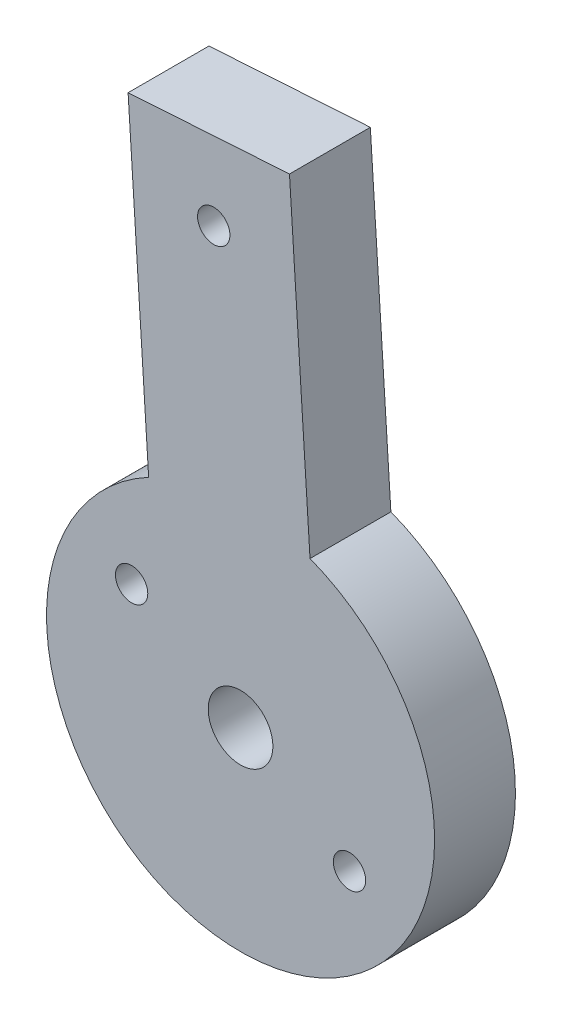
ISO-10303-21;
HEADER;
FILE_DESCRIPTION(('STEP AP214'),'2;1');
FILE_NAME('part.step','',(''),(''),'','','');
FILE_SCHEMA(('AUTOMOTIVE_DESIGN { 1 0 10303 214 1 1 1 1 }'));
ENDSEC;
DATA;
#1=APPLICATION_CONTEXT('core data for automotive mechanical design processes');
#2=APPLICATION_PROTOCOL_DEFINITION('international standard','automotive_design',2000,#1);
#3=PRODUCT_CONTEXT('',#1,'mechanical');
#4=PRODUCT('Part','Part','',(#3));
#5=PRODUCT_RELATED_PRODUCT_CATEGORY('part','',(#4));
#6=PRODUCT_DEFINITION_FORMATION('','',#4);
#7=PRODUCT_DEFINITION_CONTEXT('part definition',#1,'design');
#8=PRODUCT_DEFINITION('design','',#6,#7);
#9=PRODUCT_DEFINITION_SHAPE('','',#8);
#10=(LENGTH_UNIT() NAMED_UNIT(*) SI_UNIT(.MILLI.,.METRE.));
#11=(NAMED_UNIT(*) PLANE_ANGLE_UNIT() SI_UNIT($,.RADIAN.));
#12=(NAMED_UNIT(*) SI_UNIT($,.STERADIAN.) SOLID_ANGLE_UNIT());
#13=UNCERTAINTY_MEASURE_WITH_UNIT(LENGTH_MEASURE(1.E-05),#10,'distance_accuracy_value','');
#14=(GEOMETRIC_REPRESENTATION_CONTEXT(3) GLOBAL_UNCERTAINTY_ASSIGNED_CONTEXT((#13)) GLOBAL_UNIT_ASSIGNED_CONTEXT((#10,
#11,#12)) REPRESENTATION_CONTEXT('',''));
#15=CARTESIAN_POINT('',(0.,0.,0.));
#16=DIRECTION('',(0.,0.,1.));
#17=DIRECTION('',(1.,0.,0.));
#18=AXIS2_PLACEMENT_3D('',#15,#16,#17);
#19=CARTESIAN_POINT('',(0.,0.,5.));
#20=DIRECTION('',(0.,0.,-1.));
#21=DIRECTION('',(-1.,0.,0.));
#22=AXIS2_PLACEMENT_3D('',#19,#20,#21);
#23=CYLINDRICAL_SURFACE('',#22,12.);
#24=CARTESIAN_POINT('',(0.,0.,0.));
#25=DIRECTION('',(0.,0.,1.));
#26=DIRECTION('',(1.,0.,0.));
#27=AXIS2_PLACEMENT_3D('',#24,#25,#26);
#28=CIRCLE('',#27,12.);
#29=CARTESIAN_POINT('',(-5.68309782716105,10.5689355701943,0.));
#30=VERTEX_POINT('',#29);
#31=CARTESIAN_POINT('',(4.29669138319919,11.2043939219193,0.));
#32=VERTEX_POINT('',#31);
#33=EDGE_CURVE('E96',#30,#32,#28,.T.);
#34=ORIENTED_EDGE('',*,*,#33,.T.);
#35=DIRECTION('',(0.,0.,-1.));
#36=VECTOR('',#35,1.);
#37=CARTESIAN_POINT('',(4.29669138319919,11.2043939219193,5.));
#38=LINE('',#37,#36);
#39=CARTESIAN_POINT('',(4.29669138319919,11.2043939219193,5.));
#40=VERTEX_POINT('',#39);
#41=EDGE_CURVE('E11',#40,#32,#38,.T.);
#42=ORIENTED_EDGE('',*,*,#41,.F.);
#43=CARTESIAN_POINT('',(0.,0.,5.));
#44=DIRECTION('',(0.,0.,1.));
#45=DIRECTION('',(1.,0.,0.));
#46=AXIS2_PLACEMENT_3D('',#43,#44,#45);
#47=CIRCLE('',#46,12.);
#48=CARTESIAN_POINT('',(-5.68309782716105,10.5689355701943,5.));
#49=VERTEX_POINT('',#48);
#50=EDGE_CURVE('E84',#49,#40,#47,.T.);
#51=ORIENTED_EDGE('',*,*,#50,.F.);
#52=DIRECTION('',(0.,0.,-1.));
#53=VECTOR('',#52,1.);
#54=CARTESIAN_POINT('',(-5.68309782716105,10.5689355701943,5.));
#55=LINE('',#54,#53);
#56=EDGE_CURVE('E92',#49,#30,#55,.T.);
#57=ORIENTED_EDGE('',*,*,#56,.T.);
#58=EDGE_LOOP('',(#34,#42,#51,#57));
#59=FACE_BOUND('',#58,.T.);
#60=ADVANCED_FACE('F33',(#59),#23,.T.);
#61=CARTESIAN_POINT('',(3.02577467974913,31.1639723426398,5.));
#62=DIRECTION('',(-0.997978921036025,-0.0635458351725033,0.));
#63=DIRECTION('',(0.0635458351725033,-0.997978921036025,0.));
#64=AXIS2_PLACEMENT_3D('',#61,#62,#63);
#65=PLANE('',#64);
#66=DIRECTION('',(-0.0635458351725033,0.997978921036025,0.));
#67=VECTOR('',#66,1.);
#68=CARTESIAN_POINT('',(3.02577467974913,31.1639723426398,0.));
#69=LINE('',#68,#67);
#70=CARTESIAN_POINT('',(3.02577467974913,31.1639723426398,0.));
#71=VERTEX_POINT('',#70);
#72=EDGE_CURVE('E88',#32,#71,#69,.T.);
#73=ORIENTED_EDGE('',*,*,#72,.T.);
#74=DIRECTION('',(0.,0.,-1.));
#75=VECTOR('',#74,1.);
#76=CARTESIAN_POINT('',(3.02577467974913,31.1639723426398,5.));
#77=LINE('',#76,#75);
#78=CARTESIAN_POINT('',(3.02577467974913,31.1639723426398,5.));
#79=VERTEX_POINT('',#78);
#80=EDGE_CURVE('E41',#79,#71,#77,.T.);
#81=ORIENTED_EDGE('',*,*,#80,.F.);
#82=DIRECTION('',(-0.0635458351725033,0.997978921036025,0.));
#83=VECTOR('',#82,1.);
#84=CARTESIAN_POINT('',(3.02577467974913,31.1639723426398,5.));
#85=LINE('',#84,#83);
#86=EDGE_CURVE('E79',#40,#79,#85,.T.);
#87=ORIENTED_EDGE('',*,*,#86,.F.);
#88=ORIENTED_EDGE('',*,*,#41,.T.);
#89=EDGE_LOOP('',(#73,#81,#87,#88));
#90=FACE_BOUND('',#89,.T.);
#91=ADVANCED_FACE('F87',(#90),#65,.F.);
#92=CARTESIAN_POINT('',(-6.95401453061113,30.5285139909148,5.));
#93=DIRECTION('',(0.0635458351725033,-0.997978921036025,0.));
#94=DIRECTION('',(0.997978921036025,0.0635458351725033,0.));
#95=AXIS2_PLACEMENT_3D('',#92,#93,#94);
#96=PLANE('',#95);
#97=DIRECTION('',(-0.997978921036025,-0.0635458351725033,0.));
#98=VECTOR('',#97,1.);
#99=CARTESIAN_POINT('',(-6.95401453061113,30.5285139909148,0.));
#100=LINE('',#99,#98);
#101=CARTESIAN_POINT('',(-6.95401453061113,30.5285139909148,0.));
#102=VERTEX_POINT('',#101);
#103=EDGE_CURVE('E66',#71,#102,#100,.T.);
#104=ORIENTED_EDGE('',*,*,#103,.T.);
#105=DIRECTION('',(0.,0.,-1.));
#106=VECTOR('',#105,1.);
#107=CARTESIAN_POINT('',(-6.95401453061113,30.5285139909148,5.));
#108=LINE('',#107,#106);
#109=CARTESIAN_POINT('',(-6.95401453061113,30.5285139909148,5.));
#110=VERTEX_POINT('',#109);
#111=EDGE_CURVE('E89',#110,#102,#108,.T.);
#112=ORIENTED_EDGE('',*,*,#111,.F.);
#113=DIRECTION('',(-0.997978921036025,-0.0635458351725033,0.));
#114=VECTOR('',#113,1.);
#115=CARTESIAN_POINT('',(-6.95401453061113,30.5285139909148,5.));
#116=LINE('',#115,#114);
#117=EDGE_CURVE('E82',#79,#110,#116,.T.);
#118=ORIENTED_EDGE('',*,*,#117,.F.);
#119=ORIENTED_EDGE('',*,*,#80,.T.);
#120=EDGE_LOOP('',(#104,#112,#118,#119));
#121=FACE_BOUND('',#120,.T.);
#122=ADVANCED_FACE('F90',(#121),#96,.F.);
#123=CARTESIAN_POINT('',(-5.68309782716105,10.5689355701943,5.));
#124=DIRECTION('',(0.997978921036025,0.0635458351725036,0.));
#125=DIRECTION('',(-0.0635458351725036,0.997978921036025,0.));
#126=AXIS2_PLACEMENT_3D('',#123,#124,#125);
#127=PLANE('',#126);
#128=DIRECTION('',(0.0635458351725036,-0.997978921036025,0.));
#129=VECTOR('',#128,1.);
#130=CARTESIAN_POINT('',(-5.68309782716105,10.5689355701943,0.));
#131=LINE('',#130,#129);
#132=EDGE_CURVE('E72',#102,#30,#131,.T.);
#133=ORIENTED_EDGE('',*,*,#132,.T.);
#134=ORIENTED_EDGE('',*,*,#56,.F.);
#135=DIRECTION('',(0.0635458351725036,-0.997978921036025,0.));
#136=VECTOR('',#135,1.);
#137=CARTESIAN_POINT('',(-5.68309782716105,10.5689355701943,5.));
#138=LINE('',#137,#136);
#139=EDGE_CURVE('E49',#110,#49,#138,.T.);
#140=ORIENTED_EDGE('',*,*,#139,.F.);
#141=ORIENTED_EDGE('',*,*,#111,.T.);
#142=EDGE_LOOP('',(#133,#134,#140,#141));
#143=FACE_BOUND('',#142,.T.);
#144=ADVANCED_FACE('F104',(#143),#127,.F.);
#145=CARTESIAN_POINT('',(0.,0.,5.));
#146=DIRECTION('',(0.,0.,1.));
#147=DIRECTION('',(1.,0.,0.));
#148=AXIS2_PLACEMENT_3D('',#145,#146,#147);
#149=PLANE('',#148);
#150=CARTESIAN_POINT('',(-6.73703016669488,4.31421192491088,5.));
#151=DIRECTION('',(0.,0.,1.));
#152=DIRECTION('',(1.,0.,0.));
#153=AXIS2_PLACEMENT_3D('',#150,#151,#152);
#154=CIRCLE('',#153,1.);
#155=CARTESIAN_POINT('',(-5.73703016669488,4.31421192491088,5.));
#156=VERTEX_POINT('',#155);
#157=EDGE_CURVE('E128',#156,#156,#154,.T.);
#158=ORIENTED_EDGE('',*,*,#157,.F.);
#159=EDGE_LOOP('',(#158));
#160=FACE_BOUND('',#159,.T.);
#161=CARTESIAN_POINT('',(6.73703016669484,-4.31421192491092,5.));
#162=DIRECTION('',(0.,0.,1.));
#163=DIRECTION('',(1.,0.,0.));
#164=AXIS2_PLACEMENT_3D('',#161,#162,#163);
#165=CIRCLE('',#164,1.);
#166=CARTESIAN_POINT('',(7.73703016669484,-4.31421192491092,5.));
#167=VERTEX_POINT('',#166);
#168=EDGE_CURVE('E122',#167,#167,#165,.T.);
#169=ORIENTED_EDGE('',*,*,#168,.F.);
#170=EDGE_LOOP('',(#169));
#171=FACE_BOUND('',#170,.T.);
#172=CARTESIAN_POINT('',(-1.65841869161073,26.0452457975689,5.));
#173=DIRECTION('',(0.,0.,1.));
#174=DIRECTION('',(1.,0.,0.));
#175=AXIS2_PLACEMENT_3D('',#172,#173,#174);
#176=CIRCLE('',#175,1.);
#177=CARTESIAN_POINT('',(-0.658418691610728,26.0452457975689,5.));
#178=VERTEX_POINT('',#177);
#179=EDGE_CURVE('E116',#178,#178,#176,.T.);
#180=ORIENTED_EDGE('',*,*,#179,.F.);
#181=EDGE_LOOP('',(#180));
#182=FACE_BOUND('',#181,.T.);
#183=CARTESIAN_POINT('',(0.,0.,5.));
#184=DIRECTION('',(0.,0.,1.));
#185=DIRECTION('',(1.,0.,0.));
#186=AXIS2_PLACEMENT_3D('',#183,#184,#185);
#187=CIRCLE('',#186,2.);
#188=CARTESIAN_POINT('',(2.,0.,5.));
#189=VERTEX_POINT('',#188);
#190=EDGE_CURVE('E110',#189,#189,#187,.T.);
#191=ORIENTED_EDGE('',*,*,#190,.F.);
#192=EDGE_LOOP('',(#191));
#193=FACE_BOUND('',#192,.T.);
#194=ORIENTED_EDGE('',*,*,#50,.T.);
#195=ORIENTED_EDGE('',*,*,#86,.T.);
#196=ORIENTED_EDGE('',*,*,#117,.T.);
#197=ORIENTED_EDGE('',*,*,#139,.T.);
#198=EDGE_LOOP('',(#194,#195,#196,#197));
#199=FACE_BOUND('',#198,.T.);
#200=ADVANCED_FACE('F80',(#160,#171,#182,#193,#199),#149,.T.);
#201=CARTESIAN_POINT('',(0.,0.,0.));
#202=DIRECTION('',(0.,0.,1.));
#203=DIRECTION('',(1.,0.,0.));
#204=AXIS2_PLACEMENT_3D('',#201,#202,#203);
#205=PLANE('',#204);
#206=CARTESIAN_POINT('',(-6.73703016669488,4.31421192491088,0.));
#207=DIRECTION('',(0.,0.,1.));
#208=DIRECTION('',(1.,0.,0.));
#209=AXIS2_PLACEMENT_3D('',#206,#207,#208);
#210=CIRCLE('',#209,1.);
#211=CARTESIAN_POINT('',(-5.73703016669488,4.31421192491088,0.));
#212=VERTEX_POINT('',#211);
#213=EDGE_CURVE('E125',#212,#212,#210,.T.);
#214=ORIENTED_EDGE('',*,*,#213,.T.);
#215=EDGE_LOOP('',(#214));
#216=FACE_BOUND('',#215,.T.);
#217=CARTESIAN_POINT('',(6.73703016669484,-4.31421192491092,0.));
#218=DIRECTION('',(0.,0.,1.));
#219=DIRECTION('',(1.,0.,0.));
#220=AXIS2_PLACEMENT_3D('',#217,#218,#219);
#221=CIRCLE('',#220,1.);
#222=CARTESIAN_POINT('',(7.73703016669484,-4.31421192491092,0.));
#223=VERTEX_POINT('',#222);
#224=EDGE_CURVE('E119',#223,#223,#221,.T.);
#225=ORIENTED_EDGE('',*,*,#224,.T.);
#226=EDGE_LOOP('',(#225));
#227=FACE_BOUND('',#226,.T.);
#228=CARTESIAN_POINT('',(-1.65841869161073,26.0452457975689,0.));
#229=DIRECTION('',(0.,0.,1.));
#230=DIRECTION('',(1.,0.,0.));
#231=AXIS2_PLACEMENT_3D('',#228,#229,#230);
#232=CIRCLE('',#231,1.);
#233=CARTESIAN_POINT('',(-0.658418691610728,26.0452457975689,0.));
#234=VERTEX_POINT('',#233);
#235=EDGE_CURVE('E113',#234,#234,#232,.T.);
#236=ORIENTED_EDGE('',*,*,#235,.T.);
#237=EDGE_LOOP('',(#236));
#238=FACE_BOUND('',#237,.T.);
#239=CARTESIAN_POINT('',(0.,0.,0.));
#240=DIRECTION('',(0.,0.,1.));
#241=DIRECTION('',(1.,0.,0.));
#242=AXIS2_PLACEMENT_3D('',#239,#240,#241);
#243=CIRCLE('',#242,2.);
#244=CARTESIAN_POINT('',(2.,0.,0.));
#245=VERTEX_POINT('',#244);
#246=EDGE_CURVE('E99',#245,#245,#243,.T.);
#247=ORIENTED_EDGE('',*,*,#246,.T.);
#248=EDGE_LOOP('',(#247));
#249=FACE_BOUND('',#248,.T.);
#250=ORIENTED_EDGE('',*,*,#33,.F.);
#251=ORIENTED_EDGE('',*,*,#132,.F.);
#252=ORIENTED_EDGE('',*,*,#103,.F.);
#253=ORIENTED_EDGE('',*,*,#72,.F.);
#254=EDGE_LOOP('',(#250,#251,#252,#253));
#255=FACE_BOUND('',#254,.T.);
#256=ADVANCED_FACE('F107',(#216,#227,#238,#249,#255),#205,.F.);
#257=CARTESIAN_POINT('',(0.,0.,0.));
#258=DIRECTION('',(0.,0.,1.));
#259=DIRECTION('',(1.,0.,0.));
#260=AXIS2_PLACEMENT_3D('',#257,#258,#259);
#261=CYLINDRICAL_SURFACE('',#260,2.);
#262=ORIENTED_EDGE('',*,*,#246,.F.);
#263=EDGE_LOOP('',(#262));
#264=FACE_BOUND('',#263,.T.);
#265=ORIENTED_EDGE('',*,*,#190,.T.);
#266=EDGE_LOOP('',(#265));
#267=FACE_BOUND('',#266,.T.);
#268=ADVANCED_FACE('F152',(#264,#267),#261,.F.);
#269=CARTESIAN_POINT('',(-1.65841869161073,26.0452457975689,0.));
#270=DIRECTION('',(0.,0.,1.));
#271=DIRECTION('',(1.,0.,0.));
#272=AXIS2_PLACEMENT_3D('',#269,#270,#271);
#273=CYLINDRICAL_SURFACE('',#272,1.);
#274=ORIENTED_EDGE('',*,*,#235,.F.);
#275=EDGE_LOOP('',(#274));
#276=FACE_BOUND('',#275,.T.);
#277=ORIENTED_EDGE('',*,*,#179,.T.);
#278=EDGE_LOOP('',(#277));
#279=FACE_BOUND('',#278,.T.);
#280=ADVANCED_FACE('F154',(#276,#279),#273,.F.);
#281=CARTESIAN_POINT('',(6.73703016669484,-4.31421192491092,0.));
#282=DIRECTION('',(0.,0.,1.));
#283=DIRECTION('',(1.,0.,0.));
#284=AXIS2_PLACEMENT_3D('',#281,#282,#283);
#285=CYLINDRICAL_SURFACE('',#284,1.);
#286=ORIENTED_EDGE('',*,*,#224,.F.);
#287=EDGE_LOOP('',(#286));
#288=FACE_BOUND('',#287,.T.);
#289=ORIENTED_EDGE('',*,*,#168,.T.);
#290=EDGE_LOOP('',(#289));
#291=FACE_BOUND('',#290,.T.);
#292=ADVANCED_FACE('F139',(#288,#291),#285,.F.);
#293=CARTESIAN_POINT('',(-6.73703016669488,4.31421192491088,0.));
#294=DIRECTION('',(0.,0.,1.));
#295=DIRECTION('',(1.,0.,0.));
#296=AXIS2_PLACEMENT_3D('',#293,#294,#295);
#297=CYLINDRICAL_SURFACE('',#296,1.);
#298=ORIENTED_EDGE('',*,*,#213,.F.);
#299=EDGE_LOOP('',(#298));
#300=FACE_BOUND('',#299,.T.);
#301=ORIENTED_EDGE('',*,*,#157,.T.);
#302=EDGE_LOOP('',(#301));
#303=FACE_BOUND('',#302,.T.);
#304=ADVANCED_FACE('F136',(#300,#303),#297,.F.);
#305=CLOSED_SHELL('',(#60,#91,#122,#144,#200,#256,#268,#280,#292,#304));
#306=MANIFOLD_SOLID_BREP('B2',#305);
#307=ADVANCED_BREP_SHAPE_REPRESENTATION('',(#18,#306),#14);
#308=SHAPE_DEFINITION_REPRESENTATION(#9,#307);
ENDSEC;
END-ISO-10303-21;
